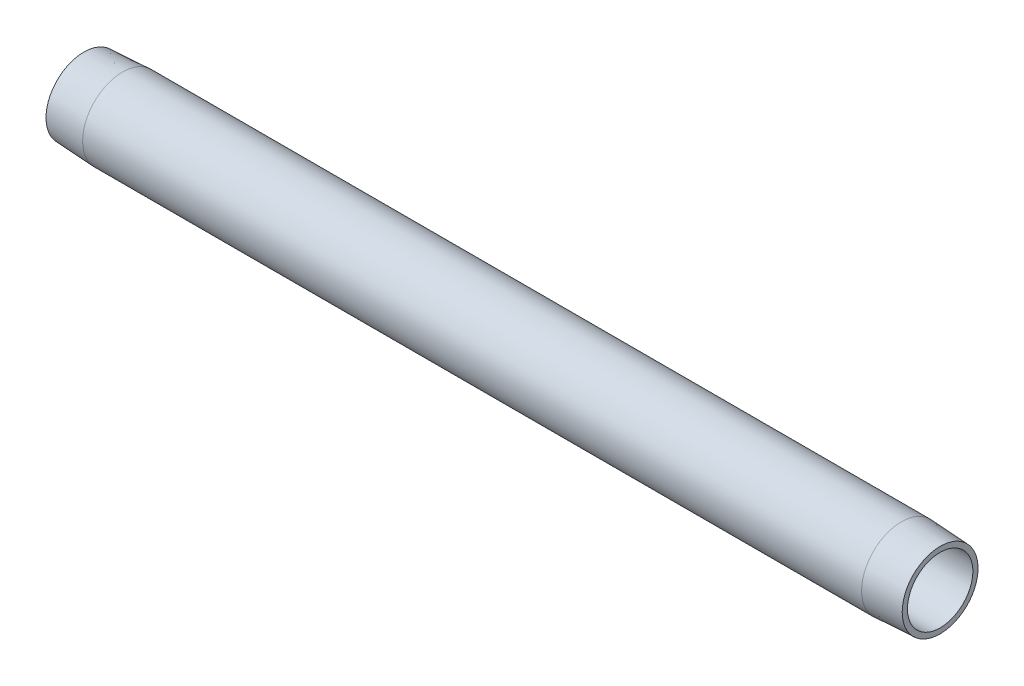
ISO-10303-21;
HEADER;
FILE_DESCRIPTION(('STEP AP214'),'2;1');
FILE_NAME('part.step','',(''),(''),'','','');
FILE_SCHEMA(('AUTOMOTIVE_DESIGN { 1 0 10303 214 1 1 1 1 }'));
ENDSEC;
DATA;
#1=APPLICATION_CONTEXT('core data for automotive mechanical design processes');
#2=APPLICATION_PROTOCOL_DEFINITION('international standard','automotive_design',2000,#1);
#3=PRODUCT_CONTEXT('',#1,'mechanical');
#4=PRODUCT('Part','Part','',(#3));
#5=PRODUCT_RELATED_PRODUCT_CATEGORY('part','',(#4));
#6=PRODUCT_DEFINITION_FORMATION('','',#4);
#7=PRODUCT_DEFINITION_CONTEXT('part definition',#1,'design');
#8=PRODUCT_DEFINITION('design','',#6,#7);
#9=PRODUCT_DEFINITION_SHAPE('','',#8);
#10=(LENGTH_UNIT() NAMED_UNIT(*) SI_UNIT(.MILLI.,.METRE.));
#11=(NAMED_UNIT(*) PLANE_ANGLE_UNIT() SI_UNIT($,.RADIAN.));
#12=(NAMED_UNIT(*) SI_UNIT($,.STERADIAN.) SOLID_ANGLE_UNIT());
#13=UNCERTAINTY_MEASURE_WITH_UNIT(LENGTH_MEASURE(1.E-05),#10,'distance_accuracy_value','');
#14=(GEOMETRIC_REPRESENTATION_CONTEXT(3) GLOBAL_UNCERTAINTY_ASSIGNED_CONTEXT((#13)) GLOBAL_UNIT_ASSIGNED_CONTEXT((#10,
#11,#12)) REPRESENTATION_CONTEXT('',''));
#15=CARTESIAN_POINT('',(0.,0.,0.));
#16=DIRECTION('',(0.,0.,1.));
#17=DIRECTION('',(1.,0.,0.));
#18=AXIS2_PLACEMENT_3D('',#15,#16,#17);
#19=CARTESIAN_POINT('',(228.6,8.73125,0.));
#20=DIRECTION('',(-1.,0.,0.));
#21=DIRECTION('',(0.,0.,1.));
#22=AXIS2_PLACEMENT_3D('',#19,#20,#21);
#23=PLANE('',#22);
#24=CARTESIAN_POINT('',(228.6,0.,0.));
#25=DIRECTION('',(-1.,0.,0.));
#26=DIRECTION('',(0.,0.,1.));
#27=AXIS2_PLACEMENT_3D('',#24,#25,#26);
#28=CIRCLE('',#27,10.1275500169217);
#29=CARTESIAN_POINT('',(228.6,0.,10.1275500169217));
#30=VERTEX_POINT('',#29);
#31=EDGE_CURVE('E10',#30,#30,#28,.T.);
#32=ORIENTED_EDGE('',*,*,#31,.F.);
#33=EDGE_LOOP('',(#32));
#34=FACE_BOUND('',#33,.T.);
#35=CARTESIAN_POINT('',(228.6,0.,0.));
#36=DIRECTION('',(-1.,0.,0.));
#37=DIRECTION('',(0.,0.,1.));
#38=AXIS2_PLACEMENT_3D('',#35,#36,#37);
#39=CIRCLE('',#38,8.73125);
#40=CARTESIAN_POINT('',(228.6,0.,8.73125));
#41=VERTEX_POINT('',#40);
#42=EDGE_CURVE('E52',#41,#41,#39,.T.);
#43=ORIENTED_EDGE('',*,*,#42,.T.);
#44=EDGE_LOOP('',(#43));
#45=FACE_BOUND('',#44,.T.);
#46=ADVANCED_FACE('F30',(#34,#45),#23,.F.);
#47=CARTESIAN_POINT('',(228.6,0.,0.));
#48=DIRECTION('',(-1.,0.,0.));
#49=DIRECTION('',(0.,0.,1.));
#50=AXIS2_PLACEMENT_3D('',#47,#48,#49);
#51=CONICAL_SURFACE('',#50,10.1275500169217,0.0523598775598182);
#52=CARTESIAN_POINT('',(218.2876,0.,0.));
#53=DIRECTION('',(-1.,0.,0.));
#54=DIRECTION('',(0.,0.,1.));
#55=AXIS2_PLACEMENT_3D('',#52,#53,#54);
#56=CIRCLE('',#55,10.668);
#57=CARTESIAN_POINT('',(218.2876,0.,10.668));
#58=VERTEX_POINT('',#57);
#59=EDGE_CURVE('E36',#58,#58,#56,.T.);
#60=ORIENTED_EDGE('',*,*,#59,.F.);
#61=EDGE_LOOP('',(#60));
#62=FACE_BOUND('',#61,.T.);
#63=ORIENTED_EDGE('',*,*,#31,.T.);
#64=EDGE_LOOP('',(#63));
#65=FACE_BOUND('',#64,.T.);
#66=ADVANCED_FACE('F77',(#62,#65),#51,.T.);
#67=CARTESIAN_POINT('',(0.,0.,0.));
#68=DIRECTION('',(-1.,0.,0.));
#69=DIRECTION('',(0.,0.,1.));
#70=AXIS2_PLACEMENT_3D('',#67,#68,#69);
#71=CYLINDRICAL_SURFACE('',#70,10.668);
#72=CARTESIAN_POINT('',(10.3124,0.,0.));
#73=DIRECTION('',(-1.,0.,0.));
#74=DIRECTION('',(0.,0.,1.));
#75=AXIS2_PLACEMENT_3D('',#72,#73,#74);
#76=CIRCLE('',#75,10.668);
#77=CARTESIAN_POINT('',(10.3124,0.,10.668));
#78=VERTEX_POINT('',#77);
#79=EDGE_CURVE('E40',#78,#78,#76,.T.);
#80=ORIENTED_EDGE('',*,*,#79,.F.);
#81=EDGE_LOOP('',(#80));
#82=FACE_BOUND('',#81,.T.);
#83=ORIENTED_EDGE('',*,*,#59,.T.);
#84=EDGE_LOOP('',(#83));
#85=FACE_BOUND('',#84,.T.);
#86=ADVANCED_FACE('F72',(#82,#85),#71,.T.);
#87=CARTESIAN_POINT('',(10.3124,0.,0.));
#88=DIRECTION('',(1.,0.,0.));
#89=DIRECTION('',(0.,0.,-1.));
#90=AXIS2_PLACEMENT_3D('',#87,#88,#89);
#91=CONICAL_SURFACE('',#90,10.668,0.0523598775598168);
#92=CARTESIAN_POINT('',(0.,0.,0.));
#93=DIRECTION('',(-1.,0.,0.));
#94=DIRECTION('',(0.,0.,1.));
#95=AXIS2_PLACEMENT_3D('',#92,#93,#94);
#96=CIRCLE('',#95,10.1275500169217);
#97=CARTESIAN_POINT('',(0.,0.,10.1275500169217));
#98=VERTEX_POINT('',#97);
#99=EDGE_CURVE('E44',#98,#98,#96,.T.);
#100=ORIENTED_EDGE('',*,*,#99,.F.);
#101=EDGE_LOOP('',(#100));
#102=FACE_BOUND('',#101,.T.);
#103=ORIENTED_EDGE('',*,*,#79,.T.);
#104=EDGE_LOOP('',(#103));
#105=FACE_BOUND('',#104,.T.);
#106=ADVANCED_FACE('F66',(#102,#105),#91,.T.);
#107=CARTESIAN_POINT('',(0.,10.1275500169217,0.));
#108=DIRECTION('',(1.,0.,0.));
#109=DIRECTION('',(0.,0.,-1.));
#110=AXIS2_PLACEMENT_3D('',#107,#108,#109);
#111=PLANE('',#110);
#112=CARTESIAN_POINT('',(0.,0.,0.));
#113=DIRECTION('',(-1.,0.,0.));
#114=DIRECTION('',(0.,0.,1.));
#115=AXIS2_PLACEMENT_3D('',#112,#113,#114);
#116=CIRCLE('',#115,8.73125);
#117=CARTESIAN_POINT('',(0.,0.,8.73125));
#118=VERTEX_POINT('',#117);
#119=EDGE_CURVE('E49',#118,#118,#116,.T.);
#120=ORIENTED_EDGE('',*,*,#119,.F.);
#121=EDGE_LOOP('',(#120));
#122=FACE_BOUND('',#121,.T.);
#123=ORIENTED_EDGE('',*,*,#99,.T.);
#124=EDGE_LOOP('',(#123));
#125=FACE_BOUND('',#124,.T.);
#126=ADVANCED_FACE('F60',(#122,#125),#111,.F.);
#127=CARTESIAN_POINT('',(0.,0.,0.));
#128=DIRECTION('',(-1.,0.,0.));
#129=DIRECTION('',(0.,0.,1.));
#130=AXIS2_PLACEMENT_3D('',#127,#128,#129);
#131=CYLINDRICAL_SURFACE('',#130,8.73125);
#132=ORIENTED_EDGE('',*,*,#42,.F.);
#133=EDGE_LOOP('',(#132));
#134=FACE_BOUND('',#133,.T.);
#135=ORIENTED_EDGE('',*,*,#119,.T.);
#136=EDGE_LOOP('',(#135));
#137=FACE_BOUND('',#136,.T.);
#138=ADVANCED_FACE('F57',(#134,#137),#131,.F.);
#139=CLOSED_SHELL('',(#46,#66,#86,#106,#126,#138));
#140=MANIFOLD_SOLID_BREP('B2',#139);
#141=ADVANCED_BREP_SHAPE_REPRESENTATION('',(#18,#140),#14);
#142=SHAPE_DEFINITION_REPRESENTATION(#9,#141);
ENDSEC;
END-ISO-10303-21;
